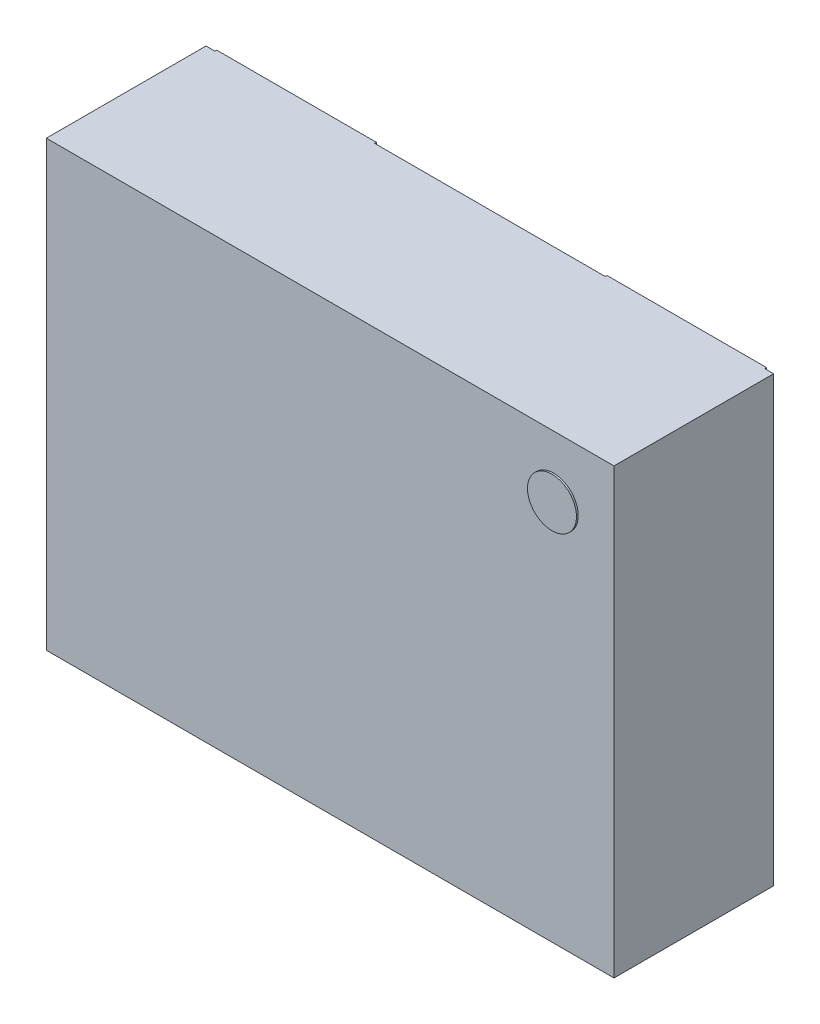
ISO-10303-21;
HEADER;
FILE_DESCRIPTION(('STEP AP214'),'2;1');
FILE_NAME('part.step','',(''),(''),'','','');
FILE_SCHEMA(('AUTOMOTIVE_DESIGN { 1 0 10303 214 1 1 1 1 }'));
ENDSEC;
DATA;
#1=APPLICATION_CONTEXT('core data for automotive mechanical design processes');
#2=APPLICATION_PROTOCOL_DEFINITION('international standard','automotive_design',2000,#1);
#3=PRODUCT_CONTEXT('',#1,'mechanical');
#4=PRODUCT('Part','Part','',(#3));
#5=PRODUCT_RELATED_PRODUCT_CATEGORY('part','',(#4));
#6=PRODUCT_DEFINITION_FORMATION('','',#4);
#7=PRODUCT_DEFINITION_CONTEXT('part definition',#1,'design');
#8=PRODUCT_DEFINITION('design','',#6,#7);
#9=PRODUCT_DEFINITION_SHAPE('','',#8);
#10=(LENGTH_UNIT() NAMED_UNIT(*) SI_UNIT(.MILLI.,.METRE.));
#11=(NAMED_UNIT(*) PLANE_ANGLE_UNIT() SI_UNIT($,.RADIAN.));
#12=(NAMED_UNIT(*) SI_UNIT($,.STERADIAN.) SOLID_ANGLE_UNIT());
#13=UNCERTAINTY_MEASURE_WITH_UNIT(LENGTH_MEASURE(1.E-05),#10,'distance_accuracy_value','');
#14=(GEOMETRIC_REPRESENTATION_CONTEXT(3) GLOBAL_UNCERTAINTY_ASSIGNED_CONTEXT((#13)) GLOBAL_UNIT_ASSIGNED_CONTEXT((#10,
#11,#12)) REPRESENTATION_CONTEXT('',''));
#15=CARTESIAN_POINT('',(0.,0.,0.));
#16=DIRECTION('',(0.,0.,1.));
#17=DIRECTION('',(1.,0.,0.));
#18=AXIS2_PLACEMENT_3D('',#15,#16,#17);
#19=CARTESIAN_POINT('',(4.9,4.65,-0.01));
#20=DIRECTION('',(0.,0.,-1.));
#21=DIRECTION('',(-1.,0.,0.));
#22=AXIS2_PLACEMENT_3D('',#19,#20,#21);
#23=PLANE('',#22);
#24=DIRECTION('',(-1.,0.,0.));
#25=VECTOR('',#24,1.);
#26=CARTESIAN_POINT('',(5.8,4.65,-0.01));
#27=LINE('',#26,#25);
#28=CARTESIAN_POINT('',(5.8,4.65,-0.01));
#29=VERTEX_POINT('',#28);
#30=CARTESIAN_POINT('',(4.9,4.65,-0.01));
#31=VERTEX_POINT('',#30);
#32=EDGE_CURVE('E285',#29,#31,#27,.T.);
#33=ORIENTED_EDGE('',*,*,#32,.T.);
#34=DIRECTION('',(0.,1.,0.));
#35=VECTOR('',#34,1.);
#36=CARTESIAN_POINT('',(4.9,4.65,-0.01));
#37=LINE('',#36,#35);
#38=CARTESIAN_POINT('',(4.9,5.45,-0.01));
#39=VERTEX_POINT('',#38);
#40=EDGE_CURVE('E430',#31,#39,#37,.T.);
#41=ORIENTED_EDGE('',*,*,#40,.T.);
#42=DIRECTION('',(1.,0.,0.));
#43=VECTOR('',#42,1.);
#44=CARTESIAN_POINT('',(5.8,5.45,-0.01));
#45=LINE('',#44,#43);
#46=CARTESIAN_POINT('',(5.8,5.45,-0.01));
#47=VERTEX_POINT('',#46);
#48=EDGE_CURVE('E27',#39,#47,#45,.T.);
#49=ORIENTED_EDGE('',*,*,#48,.T.);
#50=DIRECTION('',(0.,-1.,0.));
#51=VECTOR('',#50,1.);
#52=CARTESIAN_POINT('',(5.8,4.65,-0.01));
#53=LINE('',#52,#51);
#54=EDGE_CURVE('E11',#47,#29,#53,.T.);
#55=ORIENTED_EDGE('',*,*,#54,.T.);
#56=EDGE_LOOP('',(#33,#41,#49,#55));
#57=FACE_BOUND('',#56,.T.);
#58=ADVANCED_FACE('F18',(#57),#23,.T.);
#59=CARTESIAN_POINT('',(5.8,4.65,-0.01));
#60=DIRECTION('',(-1.,0.,0.));
#61=DIRECTION('',(0.,0.,1.));
#62=AXIS2_PLACEMENT_3D('',#59,#60,#61);
#63=PLANE('',#62);
#64=DIRECTION('',(0.,-1.,0.));
#65=VECTOR('',#64,1.);
#66=CARTESIAN_POINT('',(5.8,4.65,0.));
#67=LINE('',#66,#65);
#68=CARTESIAN_POINT('',(5.8,5.45,0.));
#69=VERTEX_POINT('',#68);
#70=CARTESIAN_POINT('',(5.8,4.65,0.));
#71=VERTEX_POINT('',#70);
#72=EDGE_CURVE('E267',#69,#71,#67,.T.);
#73=ORIENTED_EDGE('',*,*,#72,.T.);
#74=DIRECTION('',(0.,0.,1.));
#75=VECTOR('',#74,1.);
#76=CARTESIAN_POINT('',(5.8,4.65,-0.01));
#77=LINE('',#76,#75);
#78=EDGE_CURVE('E235',#29,#71,#77,.T.);
#79=ORIENTED_EDGE('',*,*,#78,.F.);
#80=ORIENTED_EDGE('',*,*,#54,.F.);
#81=DIRECTION('',(0.,0.,1.));
#82=VECTOR('',#81,1.);
#83=CARTESIAN_POINT('',(5.8,5.45,-0.01));
#84=LINE('',#83,#82);
#85=EDGE_CURVE('E464',#47,#69,#84,.T.);
#86=ORIENTED_EDGE('',*,*,#85,.T.);
#87=EDGE_LOOP('',(#73,#79,#80,#86));
#88=FACE_BOUND('',#87,.T.);
#89=ADVANCED_FACE('F20',(#88),#63,.F.);
#90=CARTESIAN_POINT('',(5.8,5.45,-0.01));
#91=DIRECTION('',(0.,-1.,0.));
#92=DIRECTION('',(-1.,0.,0.));
#93=AXIS2_PLACEMENT_3D('',#90,#91,#92);
#94=PLANE('',#93);
#95=DIRECTION('',(1.,0.,0.));
#96=VECTOR('',#95,1.);
#97=CARTESIAN_POINT('',(5.8,5.45,0.));
#98=LINE('',#97,#96);
#99=CARTESIAN_POINT('',(4.9,5.45,0.));
#100=VERTEX_POINT('',#99);
#101=EDGE_CURVE('E272',#100,#69,#98,.T.);
#102=ORIENTED_EDGE('',*,*,#101,.T.);
#103=ORIENTED_EDGE('',*,*,#85,.F.);
#104=ORIENTED_EDGE('',*,*,#48,.F.);
#105=DIRECTION('',(0.,0.,1.));
#106=VECTOR('',#105,1.);
#107=CARTESIAN_POINT('',(4.9,5.45,-0.01));
#108=LINE('',#107,#106);
#109=EDGE_CURVE('E427',#39,#100,#108,.T.);
#110=ORIENTED_EDGE('',*,*,#109,.T.);
#111=EDGE_LOOP('',(#102,#103,#104,#110));
#112=FACE_BOUND('',#111,.T.);
#113=ADVANCED_FACE('F481',(#112),#94,.F.);
#114=CARTESIAN_POINT('',(4.9,4.65,-0.01));
#115=DIRECTION('',(1.,0.,0.));
#116=DIRECTION('',(0.,1.,0.));
#117=AXIS2_PLACEMENT_3D('',#114,#115,#116);
#118=PLANE('',#117);
#119=DIRECTION('',(0.,1.,0.));
#120=VECTOR('',#119,1.);
#121=CARTESIAN_POINT('',(4.9,4.65,0.));
#122=LINE('',#121,#120);
#123=CARTESIAN_POINT('',(4.9,4.65,0.));
#124=VERTEX_POINT('',#123);
#125=EDGE_CURVE('E282',#124,#100,#122,.T.);
#126=ORIENTED_EDGE('',*,*,#125,.T.);
#127=ORIENTED_EDGE('',*,*,#109,.F.);
#128=ORIENTED_EDGE('',*,*,#40,.F.);
#129=DIRECTION('',(0.,0.,1.));
#130=VECTOR('',#129,1.);
#131=CARTESIAN_POINT('',(4.9,4.65,-0.01));
#132=LINE('',#131,#130);
#133=EDGE_CURVE('E297',#31,#124,#132,.T.);
#134=ORIENTED_EDGE('',*,*,#133,.T.);
#135=EDGE_LOOP('',(#126,#127,#128,#134));
#136=FACE_BOUND('',#135,.T.);
#137=ADVANCED_FACE('F497',(#136),#118,.F.);
#138=CARTESIAN_POINT('',(2.7,5.45,-0.01));
#139=DIRECTION('',(0.,0.,-1.));
#140=DIRECTION('',(-1.,0.,0.));
#141=AXIS2_PLACEMENT_3D('',#138,#139,#140);
#142=PLANE('',#141);
#143=DIRECTION('',(0.,1.,0.));
#144=VECTOR('',#143,1.);
#145=CARTESIAN_POINT('',(2.7,4.65,-0.01));
#146=LINE('',#145,#144);
#147=CARTESIAN_POINT('',(2.7,4.65,-0.01));
#148=VERTEX_POINT('',#147);
#149=CARTESIAN_POINT('',(2.7,5.45,-0.01));
#150=VERTEX_POINT('',#149);
#151=EDGE_CURVE('E467',#148,#150,#146,.T.);
#152=ORIENTED_EDGE('',*,*,#151,.T.);
#153=DIRECTION('',(1.,0.,0.));
#154=VECTOR('',#153,1.);
#155=CARTESIAN_POINT('',(2.7,5.45,-0.01));
#156=LINE('',#155,#154);
#157=CARTESIAN_POINT('',(3.6,5.45,-0.01));
#158=VERTEX_POINT('',#157);
#159=EDGE_CURVE('E380',#150,#158,#156,.T.);
#160=ORIENTED_EDGE('',*,*,#159,.T.);
#161=DIRECTION('',(0.,-1.,0.));
#162=VECTOR('',#161,1.);
#163=CARTESIAN_POINT('',(3.6,4.65,-0.01));
#164=LINE('',#163,#162);
#165=CARTESIAN_POINT('',(3.6,4.65,-0.01));
#166=VERTEX_POINT('',#165);
#167=EDGE_CURVE('E384',#158,#166,#164,.T.);
#168=ORIENTED_EDGE('',*,*,#167,.T.);
#169=DIRECTION('',(-1.,0.,0.));
#170=VECTOR('',#169,1.);
#171=CARTESIAN_POINT('',(2.7,4.65,-0.01));
#172=LINE('',#171,#170);
#173=EDGE_CURVE('E330',#166,#148,#172,.T.);
#174=ORIENTED_EDGE('',*,*,#173,.T.);
#175=EDGE_LOOP('',(#152,#160,#168,#174));
#176=FACE_BOUND('',#175,.T.);
#177=ADVANCED_FACE('F599',(#176),#142,.T.);
#178=CARTESIAN_POINT('',(3.6,4.65,-0.01));
#179=DIRECTION('',(-1.,0.,0.));
#180=DIRECTION('',(0.,0.,1.));
#181=AXIS2_PLACEMENT_3D('',#178,#179,#180);
#182=PLANE('',#181);
#183=DIRECTION('',(0.,-1.,0.));
#184=VECTOR('',#183,1.);
#185=CARTESIAN_POINT('',(3.6,4.65,0.));
#186=LINE('',#185,#184);
#187=CARTESIAN_POINT('',(3.6,5.45,0.));
#188=VERTEX_POINT('',#187);
#189=CARTESIAN_POINT('',(3.6,4.65,0.));
#190=VERTEX_POINT('',#189);
#191=EDGE_CURVE('E281',#188,#190,#186,.T.);
#192=ORIENTED_EDGE('',*,*,#191,.T.);
#193=DIRECTION('',(0.,0.,1.));
#194=VECTOR('',#193,1.);
#195=CARTESIAN_POINT('',(3.6,4.65,-0.01));
#196=LINE('',#195,#194);
#197=EDGE_CURVE('E327',#166,#190,#196,.T.);
#198=ORIENTED_EDGE('',*,*,#197,.F.);
#199=ORIENTED_EDGE('',*,*,#167,.F.);
#200=DIRECTION('',(0.,0.,1.));
#201=VECTOR('',#200,1.);
#202=CARTESIAN_POINT('',(3.6,5.45,-0.01));
#203=LINE('',#202,#201);
#204=EDGE_CURVE('E385',#158,#188,#203,.T.);
#205=ORIENTED_EDGE('',*,*,#204,.T.);
#206=EDGE_LOOP('',(#192,#198,#199,#205));
#207=FACE_BOUND('',#206,.T.);
#208=ADVANCED_FACE('F503',(#207),#182,.F.);
#209=CARTESIAN_POINT('',(2.7,5.45,-0.01));
#210=DIRECTION('',(0.,-1.,0.));
#211=DIRECTION('',(-1.,0.,0.));
#212=AXIS2_PLACEMENT_3D('',#209,#210,#211);
#213=PLANE('',#212);
#214=DIRECTION('',(1.,0.,0.));
#215=VECTOR('',#214,1.);
#216=CARTESIAN_POINT('',(2.7,5.45,0.));
#217=LINE('',#216,#215);
#218=CARTESIAN_POINT('',(2.7,5.45,0.));
#219=VERTEX_POINT('',#218);
#220=EDGE_CURVE('E314',#219,#188,#217,.T.);
#221=ORIENTED_EDGE('',*,*,#220,.T.);
#222=ORIENTED_EDGE('',*,*,#204,.F.);
#223=ORIENTED_EDGE('',*,*,#159,.F.);
#224=DIRECTION('',(0.,0.,1.));
#225=VECTOR('',#224,1.);
#226=CARTESIAN_POINT('',(2.7,5.45,-0.01));
#227=LINE('',#226,#225);
#228=EDGE_CURVE('E255',#150,#219,#227,.T.);
#229=ORIENTED_EDGE('',*,*,#228,.T.);
#230=EDGE_LOOP('',(#221,#222,#223,#229));
#231=FACE_BOUND('',#230,.T.);
#232=ADVANCED_FACE('F507',(#231),#213,.F.);
#233=CARTESIAN_POINT('',(2.7,4.65,-0.01));
#234=DIRECTION('',(1.,0.,0.));
#235=DIRECTION('',(0.,-1.,0.));
#236=AXIS2_PLACEMENT_3D('',#233,#234,#235);
#237=PLANE('',#236);
#238=DIRECTION('',(0.,1.,0.));
#239=VECTOR('',#238,1.);
#240=CARTESIAN_POINT('',(2.7,4.65,0.));
#241=LINE('',#240,#239);
#242=CARTESIAN_POINT('',(2.7,4.65,0.));
#243=VERTEX_POINT('',#242);
#244=EDGE_CURVE('E320',#243,#219,#241,.T.);
#245=ORIENTED_EDGE('',*,*,#244,.T.);
#246=ORIENTED_EDGE('',*,*,#228,.F.);
#247=ORIENTED_EDGE('',*,*,#151,.F.);
#248=DIRECTION('',(0.,0.,1.));
#249=VECTOR('',#248,1.);
#250=CARTESIAN_POINT('',(2.7,4.65,-0.01));
#251=LINE('',#250,#249);
#252=EDGE_CURVE('E336',#148,#243,#251,.T.);
#253=ORIENTED_EDGE('',*,*,#252,.T.);
#254=EDGE_LOOP('',(#245,#246,#247,#253));
#255=FACE_BOUND('',#254,.T.);
#256=ADVANCED_FACE('F510',(#255),#237,.F.);
#257=CARTESIAN_POINT('',(3.6,7.15,-0.01));
#258=DIRECTION('',(0.,0.,-1.));
#259=DIRECTION('',(-1.,0.,0.));
#260=AXIS2_PLACEMENT_3D('',#257,#258,#259);
#261=PLANE('',#260);
#262=DIRECTION('',(1.,0.,0.));
#263=VECTOR('',#262,1.);
#264=CARTESIAN_POINT('',(2.7,7.15,-0.01));
#265=LINE('',#264,#263);
#266=CARTESIAN_POINT('',(2.7,7.15,-0.01));
#267=VERTEX_POINT('',#266);
#268=CARTESIAN_POINT('',(3.6,7.15,-0.01));
#269=VERTEX_POINT('',#268);
#270=EDGE_CURVE('E261',#267,#269,#265,.T.);
#271=ORIENTED_EDGE('',*,*,#270,.T.);
#272=DIRECTION('',(0.,-1.,0.));
#273=VECTOR('',#272,1.);
#274=CARTESIAN_POINT('',(3.6,7.15,-0.01));
#275=LINE('',#274,#273);
#276=CARTESIAN_POINT('',(3.6,6.35,-0.01));
#277=VERTEX_POINT('',#276);
#278=EDGE_CURVE('E450',#269,#277,#275,.T.);
#279=ORIENTED_EDGE('',*,*,#278,.T.);
#280=DIRECTION('',(-1.,0.,0.));
#281=VECTOR('',#280,1.);
#282=CARTESIAN_POINT('',(2.7,6.35,-0.01));
#283=LINE('',#282,#281);
#284=CARTESIAN_POINT('',(2.7,6.35,-0.01));
#285=VERTEX_POINT('',#284);
#286=EDGE_CURVE('E457',#277,#285,#283,.T.);
#287=ORIENTED_EDGE('',*,*,#286,.T.);
#288=DIRECTION('',(0.,1.,0.));
#289=VECTOR('',#288,1.);
#290=CARTESIAN_POINT('',(2.7,7.15,-0.01));
#291=LINE('',#290,#289);
#292=EDGE_CURVE('E461',#285,#267,#291,.T.);
#293=ORIENTED_EDGE('',*,*,#292,.T.);
#294=EDGE_LOOP('',(#271,#279,#287,#293));
#295=FACE_BOUND('',#294,.T.);
#296=ADVANCED_FACE('F589',(#295),#261,.T.);
#297=CARTESIAN_POINT('',(2.7,7.15,-0.01));
#298=DIRECTION('',(1.,0.,0.));
#299=DIRECTION('',(0.,-1.,0.));
#300=AXIS2_PLACEMENT_3D('',#297,#298,#299);
#301=PLANE('',#300);
#302=DIRECTION('',(0.,1.,0.));
#303=VECTOR('',#302,1.);
#304=CARTESIAN_POINT('',(2.7,7.15,0.));
#305=LINE('',#304,#303);
#306=CARTESIAN_POINT('',(2.7,6.35,0.));
#307=VERTEX_POINT('',#306);
#308=CARTESIAN_POINT('',(2.7,7.15,0.));
#309=VERTEX_POINT('',#308);
#310=EDGE_CURVE('E315',#307,#309,#305,.T.);
#311=ORIENTED_EDGE('',*,*,#310,.T.);
#312=DIRECTION('',(0.,0.,1.));
#313=VECTOR('',#312,1.);
#314=CARTESIAN_POINT('',(2.7,7.15,-0.01));
#315=LINE('',#314,#313);
#316=EDGE_CURVE('E257',#267,#309,#315,.T.);
#317=ORIENTED_EDGE('',*,*,#316,.F.);
#318=ORIENTED_EDGE('',*,*,#292,.F.);
#319=DIRECTION('',(0.,0.,1.));
#320=VECTOR('',#319,1.);
#321=CARTESIAN_POINT('',(2.7,6.35,-0.01));
#322=LINE('',#321,#320);
#323=EDGE_CURVE('E454',#285,#307,#322,.T.);
#324=ORIENTED_EDGE('',*,*,#323,.T.);
#325=EDGE_LOOP('',(#311,#317,#318,#324));
#326=FACE_BOUND('',#325,.T.);
#327=ADVANCED_FACE('F527',(#326),#301,.F.);
#328=CARTESIAN_POINT('',(2.7,6.35,-0.01));
#329=DIRECTION('',(0.,1.,0.));
#330=DIRECTION('',(1.,0.,0.));
#331=AXIS2_PLACEMENT_3D('',#328,#329,#330);
#332=PLANE('',#331);
#333=DIRECTION('',(-1.,0.,0.));
#334=VECTOR('',#333,1.);
#335=CARTESIAN_POINT('',(2.7,6.35,0.));
#336=LINE('',#335,#334);
#337=CARTESIAN_POINT('',(3.6,6.35,0.));
#338=VERTEX_POINT('',#337);
#339=EDGE_CURVE('E319',#338,#307,#336,.T.);
#340=ORIENTED_EDGE('',*,*,#339,.T.);
#341=ORIENTED_EDGE('',*,*,#323,.F.);
#342=ORIENTED_EDGE('',*,*,#286,.F.);
#343=DIRECTION('',(0.,0.,1.));
#344=VECTOR('',#343,1.);
#345=CARTESIAN_POINT('',(3.6,6.35,-0.01));
#346=LINE('',#345,#344);
#347=EDGE_CURVE('E447',#277,#338,#346,.T.);
#348=ORIENTED_EDGE('',*,*,#347,.T.);
#349=EDGE_LOOP('',(#340,#341,#342,#348));
#350=FACE_BOUND('',#349,.T.);
#351=ADVANCED_FACE('F530',(#350),#332,.F.);
#352=CARTESIAN_POINT('',(3.6,7.15,-0.01));
#353=DIRECTION('',(-1.,0.,0.));
#354=DIRECTION('',(0.,1.,0.));
#355=AXIS2_PLACEMENT_3D('',#352,#353,#354);
#356=PLANE('',#355);
#357=DIRECTION('',(0.,-1.,0.));
#358=VECTOR('',#357,1.);
#359=CARTESIAN_POINT('',(3.6,7.15,0.));
#360=LINE('',#359,#358);
#361=CARTESIAN_POINT('',(3.6,7.15,0.));
#362=VERTEX_POINT('',#361);
#363=EDGE_CURVE('E331',#362,#338,#360,.T.);
#364=ORIENTED_EDGE('',*,*,#363,.T.);
#365=ORIENTED_EDGE('',*,*,#347,.F.);
#366=ORIENTED_EDGE('',*,*,#278,.F.);
#367=DIRECTION('',(0.,0.,1.));
#368=VECTOR('',#367,1.);
#369=CARTESIAN_POINT('',(3.6,7.15,-0.01));
#370=LINE('',#369,#368);
#371=EDGE_CURVE('E301',#269,#362,#370,.T.);
#372=ORIENTED_EDGE('',*,*,#371,.T.);
#373=EDGE_LOOP('',(#364,#365,#366,#372));
#374=FACE_BOUND('',#373,.T.);
#375=ADVANCED_FACE('F533',(#374),#356,.F.);
#376=CARTESIAN_POINT('',(5.8,6.35,-0.01));
#377=DIRECTION('',(0.,0.,-1.));
#378=DIRECTION('',(-1.,0.,0.));
#379=AXIS2_PLACEMENT_3D('',#376,#377,#378);
#380=PLANE('',#379);
#381=DIRECTION('',(0.,-1.,0.));
#382=VECTOR('',#381,1.);
#383=CARTESIAN_POINT('',(5.8,7.15,-0.01));
#384=LINE('',#383,#382);
#385=CARTESIAN_POINT('',(5.8,7.15,-0.01));
#386=VERTEX_POINT('',#385);
#387=CARTESIAN_POINT('',(5.8,6.75,-0.01));
#388=VERTEX_POINT('',#387);
#389=EDGE_CURVE('E367',#386,#388,#384,.T.);
#390=ORIENTED_EDGE('',*,*,#389,.T.);
#391=DIRECTION('',(-0.74740931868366,-0.66436383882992,0.));
#392=VECTOR('',#391,1.);
#393=CARTESIAN_POINT('',(5.8,6.75,-0.01));
#394=LINE('',#393,#392);
#395=CARTESIAN_POINT('',(5.35,6.35,-0.01));
#396=VERTEX_POINT('',#395);
#397=EDGE_CURVE('E293',#388,#396,#394,.T.);
#398=ORIENTED_EDGE('',*,*,#397,.T.);
#399=DIRECTION('',(-1.,0.,0.));
#400=VECTOR('',#399,1.);
#401=CARTESIAN_POINT('',(5.35,6.35,-0.01));
#402=LINE('',#401,#400);
#403=CARTESIAN_POINT('',(4.9,6.35,-0.01));
#404=VERTEX_POINT('',#403);
#405=EDGE_CURVE('E292',#396,#404,#402,.T.);
#406=ORIENTED_EDGE('',*,*,#405,.T.);
#407=DIRECTION('',(0.,1.,0.));
#408=VECTOR('',#407,1.);
#409=CARTESIAN_POINT('',(4.9,7.15,-0.01));
#410=LINE('',#409,#408);
#411=CARTESIAN_POINT('',(4.9,7.15,-0.01));
#412=VERTEX_POINT('',#411);
#413=EDGE_CURVE('E444',#404,#412,#410,.T.);
#414=ORIENTED_EDGE('',*,*,#413,.T.);
#415=DIRECTION('',(1.,0.,0.));
#416=VECTOR('',#415,1.);
#417=CARTESIAN_POINT('',(5.8,7.15,-0.01));
#418=LINE('',#417,#416);
#419=EDGE_CURVE('E349',#412,#386,#418,.T.);
#420=ORIENTED_EDGE('',*,*,#419,.T.);
#421=EDGE_LOOP('',(#390,#398,#406,#414,#420));
#422=FACE_BOUND('',#421,.T.);
#423=ADVANCED_FACE('F581',(#422),#380,.T.);
#424=CARTESIAN_POINT('',(4.9,7.15,-0.01));
#425=DIRECTION('',(1.,0.,0.));
#426=DIRECTION('',(0.,-1.,0.));
#427=AXIS2_PLACEMENT_3D('',#424,#425,#426);
#428=PLANE('',#427);
#429=DIRECTION('',(0.,1.,0.));
#430=VECTOR('',#429,1.);
#431=CARTESIAN_POINT('',(4.9,7.15,0.));
#432=LINE('',#431,#430);
#433=CARTESIAN_POINT('',(4.9,6.35,0.));
#434=VERTEX_POINT('',#433);
#435=CARTESIAN_POINT('',(4.9,7.15,0.));
#436=VERTEX_POINT('',#435);
#437=EDGE_CURVE('E358',#434,#436,#432,.T.);
#438=ORIENTED_EDGE('',*,*,#437,.T.);
#439=DIRECTION('',(0.,0.,1.));
#440=VECTOR('',#439,1.);
#441=CARTESIAN_POINT('',(4.9,7.15,-0.01));
#442=LINE('',#441,#440);
#443=EDGE_CURVE('E353',#412,#436,#442,.T.);
#444=ORIENTED_EDGE('',*,*,#443,.F.);
#445=ORIENTED_EDGE('',*,*,#413,.F.);
#446=DIRECTION('',(0.,0.,1.));
#447=VECTOR('',#446,1.);
#448=CARTESIAN_POINT('',(4.9,6.35,-0.01));
#449=LINE('',#448,#447);
#450=EDGE_CURVE('E289',#404,#434,#449,.T.);
#451=ORIENTED_EDGE('',*,*,#450,.T.);
#452=EDGE_LOOP('',(#438,#444,#445,#451));
#453=FACE_BOUND('',#452,.T.);
#454=ADVANCED_FACE('F542',(#453),#428,.F.);
#455=CARTESIAN_POINT('',(5.35,6.35,-0.01));
#456=DIRECTION('',(0.,1.,0.));
#457=DIRECTION('',(0.,0.,-1.));
#458=AXIS2_PLACEMENT_3D('',#455,#456,#457);
#459=PLANE('',#458);
#460=DIRECTION('',(-1.,0.,0.));
#461=VECTOR('',#460,1.);
#462=CARTESIAN_POINT('',(5.35,6.35,0.));
#463=LINE('',#462,#461);
#464=CARTESIAN_POINT('',(5.35,6.35,0.));
#465=VERTEX_POINT('',#464);
#466=EDGE_CURVE('E362',#465,#434,#463,.T.);
#467=ORIENTED_EDGE('',*,*,#466,.T.);
#468=ORIENTED_EDGE('',*,*,#450,.F.);
#469=ORIENTED_EDGE('',*,*,#405,.F.);
#470=DIRECTION('',(0.,0.,1.));
#471=VECTOR('',#470,1.);
#472=CARTESIAN_POINT('',(5.35,6.35,-0.01));
#473=LINE('',#472,#471);
#474=EDGE_CURVE('E371',#396,#465,#473,.T.);
#475=ORIENTED_EDGE('',*,*,#474,.T.);
#476=EDGE_LOOP('',(#467,#468,#469,#475));
#477=FACE_BOUND('',#476,.T.);
#478=ADVANCED_FACE('F545',(#477),#459,.F.);
#479=CARTESIAN_POINT('',(5.8,6.75,-0.01));
#480=DIRECTION('',(-0.66436383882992,0.74740931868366,0.));
#481=DIRECTION('',(0.,0.,1.));
#482=AXIS2_PLACEMENT_3D('',#479,#480,#481);
#483=PLANE('',#482);
#484=DIRECTION('',(-0.74740931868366,-0.66436383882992,0.));
#485=VECTOR('',#484,1.);
#486=CARTESIAN_POINT('',(5.8,6.75,0.));
#487=LINE('',#486,#485);
#488=CARTESIAN_POINT('',(5.8,6.75,0.));
#489=VERTEX_POINT('',#488);
#490=EDGE_CURVE('E366',#489,#465,#487,.T.);
#491=ORIENTED_EDGE('',*,*,#490,.T.);
#492=ORIENTED_EDGE('',*,*,#474,.F.);
#493=ORIENTED_EDGE('',*,*,#397,.F.);
#494=DIRECTION('',(0.,0.,1.));
#495=VECTOR('',#494,1.);
#496=CARTESIAN_POINT('',(5.8,6.75,-0.01));
#497=LINE('',#496,#495);
#498=EDGE_CURVE('E234',#388,#489,#497,.T.);
#499=ORIENTED_EDGE('',*,*,#498,.T.);
#500=EDGE_LOOP('',(#491,#492,#493,#499));
#501=FACE_BOUND('',#500,.T.);
#502=ADVANCED_FACE('F550',(#501),#483,.F.);
#503=CARTESIAN_POINT('',(5.8,7.15,-0.01));
#504=DIRECTION('',(-1.,0.,0.));
#505=DIRECTION('',(0.,0.,1.));
#506=AXIS2_PLACEMENT_3D('',#503,#504,#505);
#507=PLANE('',#506);
#508=DIRECTION('',(0.,-1.,0.));
#509=VECTOR('',#508,1.);
#510=CARTESIAN_POINT('',(5.8,7.15,0.));
#511=LINE('',#510,#509);
#512=CARTESIAN_POINT('',(5.8,7.15,0.));
#513=VERTEX_POINT('',#512);
#514=EDGE_CURVE('E375',#513,#489,#511,.T.);
#515=ORIENTED_EDGE('',*,*,#514,.T.);
#516=ORIENTED_EDGE('',*,*,#498,.F.);
#517=ORIENTED_EDGE('',*,*,#389,.F.);
#518=DIRECTION('',(0.,0.,1.));
#519=VECTOR('',#518,1.);
#520=CARTESIAN_POINT('',(5.8,7.15,-0.01));
#521=LINE('',#520,#519);
#522=EDGE_CURVE('E354',#386,#513,#521,.T.);
#523=ORIENTED_EDGE('',*,*,#522,.T.);
#524=EDGE_LOOP('',(#515,#516,#517,#523));
#525=FACE_BOUND('',#524,.T.);
#526=ADVANCED_FACE('F553',(#525),#507,.F.);
#527=CARTESIAN_POINT('',(5.51044127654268,6.80668940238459,0.91));
#528=DIRECTION('',(0.,0.,1.));
#529=DIRECTION('',(0.,-1.,0.));
#530=AXIS2_PLACEMENT_3D('',#527,#528,#529);
#531=PLANE('',#530);
#532=CARTESIAN_POINT('',(5.51044127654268,6.80668940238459,0.91));
#533=DIRECTION('',(0.,0.,1.));
#534=DIRECTION('',(0.,1.,0.));
#535=AXIS2_PLACEMENT_3D('',#532,#533,#534);
#536=CIRCLE('',#535,0.137986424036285);
#537=CARTESIAN_POINT('',(5.51044127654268,6.6687029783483,0.91));
#538=VERTEX_POINT('',#537);
#539=CARTESIAN_POINT('',(5.51044127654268,6.94467582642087,0.91));
#540=VERTEX_POINT('',#539);
#541=EDGE_CURVE('E225',#538,#540,#536,.T.);
#542=ORIENTED_EDGE('',*,*,#541,.T.);
#543=CARTESIAN_POINT('',(5.51044127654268,6.80668940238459,0.91));
#544=DIRECTION('',(0.,0.,1.));
#545=DIRECTION('',(0.,1.,0.));
#546=AXIS2_PLACEMENT_3D('',#543,#544,#545);
#547=CIRCLE('',#546,0.137986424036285);
#548=EDGE_CURVE('E229',#540,#538,#547,.T.);
#549=ORIENTED_EDGE('',*,*,#548,.T.);
#550=EDGE_LOOP('',(#542,#549));
#551=FACE_BOUND('',#550,.T.);
#552=ADVANCED_FACE('F227',(#551),#531,.T.);
#553=CARTESIAN_POINT('',(5.51044127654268,6.80668940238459,0.91));
#554=DIRECTION('',(0.,0.,1.));
#555=DIRECTION('',(0.,-1.,0.));
#556=AXIS2_PLACEMENT_3D('',#553,#554,#555);
#557=CYLINDRICAL_SURFACE('',#556,0.137986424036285);
#558=DIRECTION('',(0.,0.,-1.));
#559=VECTOR('',#558,1.);
#560=CARTESIAN_POINT('',(5.51044127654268,6.94467582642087,0.91));
#561=LINE('',#560,#559);
#562=CARTESIAN_POINT('',(5.51044127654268,6.94467582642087,0.9));
#563=VERTEX_POINT('',#562);
#564=EDGE_CURVE('E238',#540,#563,#561,.T.);
#565=ORIENTED_EDGE('',*,*,#564,.F.);
#566=ORIENTED_EDGE('',*,*,#541,.F.);
#567=DIRECTION('',(0.,0.,-1.));
#568=VECTOR('',#567,1.);
#569=CARTESIAN_POINT('',(5.51044127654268,6.6687029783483,0.91));
#570=LINE('',#569,#568);
#571=CARTESIAN_POINT('',(5.51044127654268,6.6687029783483,0.9));
#572=VERTEX_POINT('',#571);
#573=EDGE_CURVE('E248',#538,#572,#570,.T.);
#574=ORIENTED_EDGE('',*,*,#573,.T.);
#575=CARTESIAN_POINT('',(5.51044127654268,6.80668940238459,0.9));
#576=DIRECTION('',(0.,0.,1.));
#577=DIRECTION('',(0.,-1.,0.));
#578=AXIS2_PLACEMENT_3D('',#575,#576,#577);
#579=CIRCLE('',#578,0.137986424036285);
#580=EDGE_CURVE('E240',#572,#563,#579,.T.);
#581=ORIENTED_EDGE('',*,*,#580,.T.);
#582=EDGE_LOOP('',(#565,#566,#574,#581));
#583=FACE_BOUND('',#582,.T.);
#584=ADVANCED_FACE('F239',(#583),#557,.T.);
#585=CARTESIAN_POINT('',(2.65,4.65,0.9));
#586=DIRECTION('',(0.,1.,0.));
#587=DIRECTION('',(1.,0.,0.));
#588=AXIS2_PLACEMENT_3D('',#585,#586,#587);
#589=PLANE('',#588);
#590=DIRECTION('',(1.,0.,0.));
#591=VECTOR('',#590,1.);
#592=CARTESIAN_POINT('',(2.65,4.65,0.));
#593=LINE('',#592,#591);
#594=CARTESIAN_POINT('',(2.65,4.65,0.));
#595=VERTEX_POINT('',#594);
#596=EDGE_CURVE('E307',#595,#243,#593,.T.);
#597=ORIENTED_EDGE('',*,*,#596,.T.);
#598=ORIENTED_EDGE('',*,*,#252,.F.);
#599=ORIENTED_EDGE('',*,*,#173,.F.);
#600=ORIENTED_EDGE('',*,*,#197,.T.);
#601=DIRECTION('',(1.,0.,0.));
#602=VECTOR('',#601,1.);
#603=CARTESIAN_POINT('',(2.65,4.65,0.));
#604=LINE('',#603,#602);
#605=EDGE_CURVE('E277',#190,#124,#604,.T.);
#606=ORIENTED_EDGE('',*,*,#605,.T.);
#607=ORIENTED_EDGE('',*,*,#133,.F.);
#608=ORIENTED_EDGE('',*,*,#32,.F.);
#609=ORIENTED_EDGE('',*,*,#78,.T.);
#610=DIRECTION('',(1.,0.,0.));
#611=VECTOR('',#610,1.);
#612=CARTESIAN_POINT('',(2.65,4.65,0.));
#613=LINE('',#612,#611);
#614=CARTESIAN_POINT('',(5.85,4.65,0.));
#615=VERTEX_POINT('',#614);
#616=EDGE_CURVE('E393',#71,#615,#613,.T.);
#617=ORIENTED_EDGE('',*,*,#616,.T.);
#618=DIRECTION('',(0.,0.,-1.));
#619=VECTOR('',#618,1.);
#620=CARTESIAN_POINT('',(5.85,4.65,0.9));
#621=LINE('',#620,#619);
#622=CARTESIAN_POINT('',(5.85,4.65,0.9));
#623=VERTEX_POINT('',#622);
#624=EDGE_CURVE('E276',#623,#615,#621,.T.);
#625=ORIENTED_EDGE('',*,*,#624,.F.);
#626=DIRECTION('',(1.,0.,0.));
#627=VECTOR('',#626,1.);
#628=CARTESIAN_POINT('',(2.65,4.65,0.9));
#629=LINE('',#628,#627);
#630=CARTESIAN_POINT('',(2.65,4.65,0.9));
#631=VERTEX_POINT('',#630);
#632=EDGE_CURVE('E407',#631,#623,#629,.T.);
#633=ORIENTED_EDGE('',*,*,#632,.F.);
#634=DIRECTION('',(0.,0.,-1.));
#635=VECTOR('',#634,1.);
#636=CARTESIAN_POINT('',(2.65,4.65,0.9));
#637=LINE('',#636,#635);
#638=EDGE_CURVE('E339',#631,#595,#637,.T.);
#639=ORIENTED_EDGE('',*,*,#638,.T.);
#640=EDGE_LOOP('',(#597,#598,#599,#600,#606,#607,#608,#609,#617,#625,#633,#639));
#641=FACE_BOUND('',#640,.T.);
#642=ADVANCED_FACE('F491',(#641),#589,.F.);
#643=CARTESIAN_POINT('',(2.65,4.65,0.9));
#644=DIRECTION('',(1.,0.,0.));
#645=DIRECTION('',(0.,-1.,0.));
#646=AXIS2_PLACEMENT_3D('',#643,#644,#645);
#647=PLANE('',#646);
#648=DIRECTION('',(0.,-1.,0.));
#649=VECTOR('',#648,1.);
#650=CARTESIAN_POINT('',(2.65,4.65,0.));
#651=LINE('',#650,#649);
#652=CARTESIAN_POINT('',(2.65,7.15,0.));
#653=VERTEX_POINT('',#652);
#654=EDGE_CURVE('E302',#653,#595,#651,.T.);
#655=ORIENTED_EDGE('',*,*,#654,.T.);
#656=ORIENTED_EDGE('',*,*,#638,.F.);
#657=DIRECTION('',(0.,-1.,0.));
#658=VECTOR('',#657,1.);
#659=CARTESIAN_POINT('',(2.65,4.65,0.9));
#660=LINE('',#659,#658);
#661=CARTESIAN_POINT('',(2.65,7.15,0.9));
#662=VERTEX_POINT('',#661);
#663=EDGE_CURVE('E403',#662,#631,#660,.T.);
#664=ORIENTED_EDGE('',*,*,#663,.F.);
#665=DIRECTION('',(0.,0.,-1.));
#666=VECTOR('',#665,1.);
#667=CARTESIAN_POINT('',(2.65,7.15,0.9));
#668=LINE('',#667,#666);
#669=EDGE_CURVE('E260',#662,#653,#668,.T.);
#670=ORIENTED_EDGE('',*,*,#669,.T.);
#671=EDGE_LOOP('',(#655,#656,#664,#670));
#672=FACE_BOUND('',#671,.T.);
#673=ADVANCED_FACE('F517',(#672),#647,.F.);
#674=CARTESIAN_POINT('',(2.65,7.15,0.9));
#675=DIRECTION('',(0.,-1.,0.));
#676=DIRECTION('',(-1.,0.,0.));
#677=AXIS2_PLACEMENT_3D('',#674,#675,#676);
#678=PLANE('',#677);
#679=DIRECTION('',(-1.,0.,0.));
#680=VECTOR('',#679,1.);
#681=CARTESIAN_POINT('',(2.65,7.15,0.));
#682=LINE('',#681,#680);
#683=CARTESIAN_POINT('',(5.85,7.15,0.));
#684=VERTEX_POINT('',#683);
#685=EDGE_CURVE('E379',#684,#513,#682,.T.);
#686=ORIENTED_EDGE('',*,*,#685,.T.);
#687=ORIENTED_EDGE('',*,*,#522,.F.);
#688=ORIENTED_EDGE('',*,*,#419,.F.);
#689=ORIENTED_EDGE('',*,*,#443,.T.);
#690=DIRECTION('',(-1.,0.,0.));
#691=VECTOR('',#690,1.);
#692=CARTESIAN_POINT('',(2.65,7.15,0.));
#693=LINE('',#692,#691);
#694=EDGE_CURVE('E335',#436,#362,#693,.T.);
#695=ORIENTED_EDGE('',*,*,#694,.T.);
#696=ORIENTED_EDGE('',*,*,#371,.F.);
#697=ORIENTED_EDGE('',*,*,#270,.F.);
#698=ORIENTED_EDGE('',*,*,#316,.T.);
#699=DIRECTION('',(-1.,0.,0.));
#700=VECTOR('',#699,1.);
#701=CARTESIAN_POINT('',(2.65,7.15,0.));
#702=LINE('',#701,#700);
#703=EDGE_CURVE('E306',#309,#653,#702,.T.);
#704=ORIENTED_EDGE('',*,*,#703,.T.);
#705=ORIENTED_EDGE('',*,*,#669,.F.);
#706=DIRECTION('',(-1.,0.,0.));
#707=VECTOR('',#706,1.);
#708=CARTESIAN_POINT('',(2.65,7.15,0.9));
#709=LINE('',#708,#707);
#710=CARTESIAN_POINT('',(5.85,7.15,0.9));
#711=VERTEX_POINT('',#710);
#712=EDGE_CURVE('E266',#711,#662,#709,.T.);
#713=ORIENTED_EDGE('',*,*,#712,.F.);
#714=DIRECTION('',(0.,0.,-1.));
#715=VECTOR('',#714,1.);
#716=CARTESIAN_POINT('',(5.85,7.15,0.9));
#717=LINE('',#716,#715);
#718=EDGE_CURVE('E273',#711,#684,#717,.T.);
#719=ORIENTED_EDGE('',*,*,#718,.T.);
#720=EDGE_LOOP('',(#686,#687,#688,#689,#695,#696,#697,#698,#704,#705,#713,#719));
#721=FACE_BOUND('',#720,.T.);
#722=ADVANCED_FACE('F520',(#721),#678,.F.);
#723=CARTESIAN_POINT('',(5.85,4.65,0.9));
#724=DIRECTION('',(-1.,0.,0.));
#725=DIRECTION('',(0.,1.,0.));
#726=AXIS2_PLACEMENT_3D('',#723,#724,#725);
#727=PLANE('',#726);
#728=DIRECTION('',(0.,1.,0.));
#729=VECTOR('',#728,1.);
#730=CARTESIAN_POINT('',(5.85,4.65,0.));
#731=LINE('',#730,#729);
#732=EDGE_CURVE('E389',#615,#684,#731,.T.);
#733=ORIENTED_EDGE('',*,*,#732,.T.);
#734=ORIENTED_EDGE('',*,*,#718,.F.);
#735=DIRECTION('',(0.,1.,0.));
#736=VECTOR('',#735,1.);
#737=CARTESIAN_POINT('',(5.85,4.65,0.9));
#738=LINE('',#737,#736);
#739=EDGE_CURVE('E262',#623,#711,#738,.T.);
#740=ORIENTED_EDGE('',*,*,#739,.F.);
#741=ORIENTED_EDGE('',*,*,#624,.T.);
#742=EDGE_LOOP('',(#733,#734,#740,#741));
#743=FACE_BOUND('',#742,.T.);
#744=ADVANCED_FACE('F556',(#743),#727,.F.);
#745=CARTESIAN_POINT('',(5.85,7.15,0.9));
#746=DIRECTION('',(0.,0.,-1.));
#747=DIRECTION('',(-1.,0.,0.));
#748=AXIS2_PLACEMENT_3D('',#745,#746,#747);
#749=PLANE('',#748);
#750=ORIENTED_EDGE('',*,*,#580,.F.);
#751=CARTESIAN_POINT('',(5.51044127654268,6.80668940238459,0.9));
#752=DIRECTION('',(0.,0.,1.));
#753=DIRECTION('',(0.,-1.,0.));
#754=AXIS2_PLACEMENT_3D('',#751,#752,#753);
#755=CIRCLE('',#754,0.137986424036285);
#756=EDGE_CURVE('E245',#563,#572,#755,.T.);
#757=ORIENTED_EDGE('',*,*,#756,.F.);
#758=EDGE_LOOP('',(#750,#757));
#759=FACE_BOUND('',#758,.T.);
#760=ORIENTED_EDGE('',*,*,#739,.T.);
#761=ORIENTED_EDGE('',*,*,#712,.T.);
#762=ORIENTED_EDGE('',*,*,#663,.T.);
#763=ORIENTED_EDGE('',*,*,#632,.T.);
#764=EDGE_LOOP('',(#760,#761,#762,#763));
#765=FACE_BOUND('',#764,.T.);
#766=ADVANCED_FACE('F558',(#759,#765),#749,.F.);
#767=CARTESIAN_POINT('',(5.85,7.15,0.));
#768=DIRECTION('',(0.,0.,-1.));
#769=DIRECTION('',(-1.,0.,0.));
#770=AXIS2_PLACEMENT_3D('',#767,#768,#769);
#771=PLANE('',#770);
#772=ORIENTED_EDGE('',*,*,#101,.F.);
#773=ORIENTED_EDGE('',*,*,#125,.F.);
#774=ORIENTED_EDGE('',*,*,#605,.F.);
#775=ORIENTED_EDGE('',*,*,#191,.F.);
#776=ORIENTED_EDGE('',*,*,#220,.F.);
#777=ORIENTED_EDGE('',*,*,#244,.F.);
#778=ORIENTED_EDGE('',*,*,#596,.F.);
#779=ORIENTED_EDGE('',*,*,#654,.F.);
#780=ORIENTED_EDGE('',*,*,#703,.F.);
#781=ORIENTED_EDGE('',*,*,#310,.F.);
#782=ORIENTED_EDGE('',*,*,#339,.F.);
#783=ORIENTED_EDGE('',*,*,#363,.F.);
#784=ORIENTED_EDGE('',*,*,#694,.F.);
#785=ORIENTED_EDGE('',*,*,#437,.F.);
#786=ORIENTED_EDGE('',*,*,#466,.F.);
#787=ORIENTED_EDGE('',*,*,#490,.F.);
#788=ORIENTED_EDGE('',*,*,#514,.F.);
#789=ORIENTED_EDGE('',*,*,#685,.F.);
#790=ORIENTED_EDGE('',*,*,#732,.F.);
#791=ORIENTED_EDGE('',*,*,#616,.F.);
#792=ORIENTED_EDGE('',*,*,#72,.F.);
#793=EDGE_LOOP('',(#772,#773,#774,#775,#776,#777,#778,#779,#780,#781,#782,#783,#784,#785,#786,
#787,#788,#789,#790,#791,#792));
#794=FACE_BOUND('',#793,.T.);
#795=ADVANCED_FACE('F486',(#794),#771,.T.);
#796=CARTESIAN_POINT('',(5.51044127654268,6.80668940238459,0.91));
#797=DIRECTION('',(0.,0.,1.));
#798=DIRECTION('',(0.,-1.,0.));
#799=AXIS2_PLACEMENT_3D('',#796,#797,#798);
#800=CYLINDRICAL_SURFACE('',#799,0.137986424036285);
#801=ORIENTED_EDGE('',*,*,#548,.F.);
#802=ORIENTED_EDGE('',*,*,#564,.T.);
#803=ORIENTED_EDGE('',*,*,#756,.T.);
#804=ORIENTED_EDGE('',*,*,#573,.F.);
#805=EDGE_LOOP('',(#801,#802,#803,#804));
#806=FACE_BOUND('',#805,.T.);
#807=ADVANCED_FACE('F247',(#806),#800,.T.);
#808=CLOSED_SHELL('',(#58,#89,#113,#137,#177,#208,#232,#256,#296,#327,#351,#375,#423,#454,#478,
#502,#526,#552,#584,#642,#673,#722,#744,#766,#795,#807));
#809=MANIFOLD_SOLID_BREP('B1',#808);
#810=ADVANCED_BREP_SHAPE_REPRESENTATION('',(#18,#809),#14);
#811=SHAPE_DEFINITION_REPRESENTATION(#9,#810);
ENDSEC;
END-ISO-10303-21;
